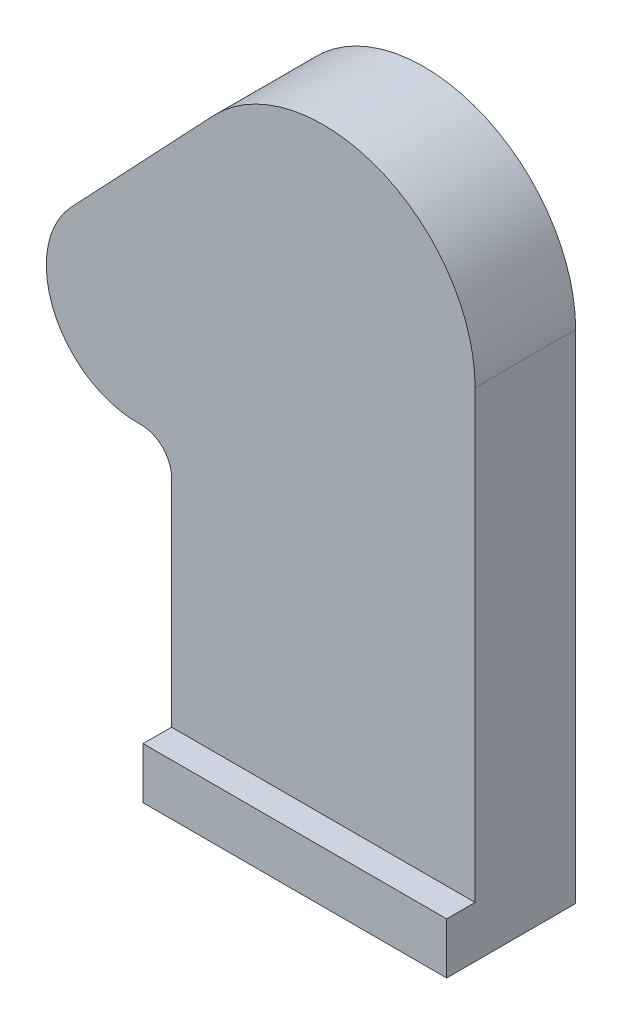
from build123d import *

# Parameters (mm, degrees)
EXTRUSION1_DEPTH = 53
ESQUISSE3_W      = 160
ESQUISSE3_H      = 27
EXTRUSION2_DEPTH = 15


with BuildPart() as part:
    # Esquisse1 → Extrusion1 (new body)
    with BuildSketch(Plane.XY):
        with BuildLine():
            Line((-80, -120.968742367), (-80, -262))
            Line((-80, -262), (80, -262))
            Line((80, -262), (80, 0))
            ThreePointArc((80, 0), (29.593522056, 74.325119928), (-58.105586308, 54.988551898))
            Line((-58.105586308, 54.988551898), (-132.863351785, -24.006868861))
            ThreePointArc((-132.863351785, -24.006868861), (-141.786994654, -76.664666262), (-96.5, -104.976556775))
            ThreePointArc((-96.5, -104.976556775), (-84.864471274, -109.479617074), (-80, -120.968742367))
        make_face()
    extrude(amount=EXTRUSION1_DEPTH)

    # Esquisse3 → Extrusion2 (add)
    with BuildSketch(Plane.XY.offset(53)):
        with Locations((0, -248.5)):
            Rectangle(ESQUISSE3_W, ESQUISSE3_H)
    extrude(amount=EXTRUSION2_DEPTH)


solid = part.part
